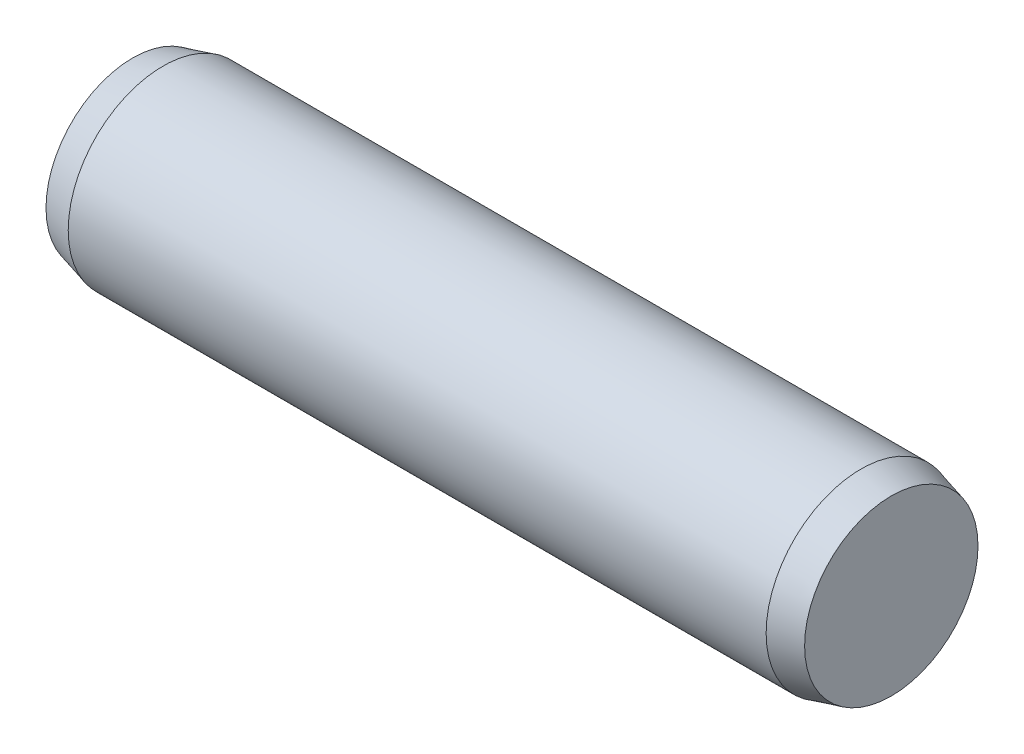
ISO-10303-21;
HEADER;
FILE_DESCRIPTION(('STEP AP214'),'2;1');
FILE_NAME('part.step','',(''),(''),'','','');
FILE_SCHEMA(('AUTOMOTIVE_DESIGN { 1 0 10303 214 1 1 1 1 }'));
ENDSEC;
DATA;
#1=APPLICATION_CONTEXT('core data for automotive mechanical design processes');
#2=APPLICATION_PROTOCOL_DEFINITION('international standard','automotive_design',2000,#1);
#3=PRODUCT_CONTEXT('',#1,'mechanical');
#4=PRODUCT('Part','Part','',(#3));
#5=PRODUCT_RELATED_PRODUCT_CATEGORY('part','',(#4));
#6=PRODUCT_DEFINITION_FORMATION('','',#4);
#7=PRODUCT_DEFINITION_CONTEXT('part definition',#1,'design');
#8=PRODUCT_DEFINITION('design','',#6,#7);
#9=PRODUCT_DEFINITION_SHAPE('','',#8);
#10=(LENGTH_UNIT() NAMED_UNIT(*) SI_UNIT(.MILLI.,.METRE.));
#11=(NAMED_UNIT(*) PLANE_ANGLE_UNIT() SI_UNIT($,.RADIAN.));
#12=(NAMED_UNIT(*) SI_UNIT($,.STERADIAN.) SOLID_ANGLE_UNIT());
#13=UNCERTAINTY_MEASURE_WITH_UNIT(LENGTH_MEASURE(1.E-05),#10,'distance_accuracy_value','');
#14=(GEOMETRIC_REPRESENTATION_CONTEXT(3) GLOBAL_UNCERTAINTY_ASSIGNED_CONTEXT((#13)) GLOBAL_UNIT_ASSIGNED_CONTEXT((#10,
#11,#12)) REPRESENTATION_CONTEXT('',''));
#15=CARTESIAN_POINT('',(0.,0.,0.));
#16=DIRECTION('',(0.,0.,1.));
#17=DIRECTION('',(1.,0.,0.));
#18=AXIS2_PLACEMENT_3D('',#15,#16,#17);
#19=CARTESIAN_POINT('',(-4.6,0.,0.));
#20=DIRECTION('',(1.,0.,0.));
#21=DIRECTION('',(0.,0.,-1.));
#22=AXIS2_PLACEMENT_3D('',#19,#20,#21);
#23=CYLINDRICAL_SURFACE('',#22,1.25);
#24=CARTESIAN_POINT('',(-4.6,0.,0.));
#25=DIRECTION('',(-1.,0.,0.));
#26=DIRECTION('',(0.,0.,1.));
#27=AXIS2_PLACEMENT_3D('',#24,#25,#26);
#28=CIRCLE('',#27,1.25);
#29=CARTESIAN_POINT('',(-4.6,0.,1.25));
#30=VERTEX_POINT('',#29);
#31=EDGE_CURVE('E44',#30,#30,#28,.T.);
#32=ORIENTED_EDGE('',*,*,#31,.F.);
#33=EDGE_LOOP('',(#32));
#34=FACE_BOUND('',#33,.T.);
#35=CARTESIAN_POINT('',(4.6,0.,0.));
#36=DIRECTION('',(1.,0.,0.));
#37=DIRECTION('',(0.,0.,-1.));
#38=AXIS2_PLACEMENT_3D('',#35,#36,#37);
#39=CIRCLE('',#38,1.25);
#40=CARTESIAN_POINT('',(4.6,0.,-1.25));
#41=VERTEX_POINT('',#40);
#42=EDGE_CURVE('E10',#41,#41,#39,.T.);
#43=ORIENTED_EDGE('',*,*,#42,.F.);
#44=EDGE_LOOP('',(#43));
#45=FACE_BOUND('',#44,.T.);
#46=ADVANCED_FACE('F30',(#34,#45),#23,.T.);
#47=CARTESIAN_POINT('',(4.6,0.,0.));
#48=DIRECTION('',(-1.,0.,0.));
#49=DIRECTION('',(0.,0.,-1.));
#50=AXIS2_PLACEMENT_3D('',#47,#48,#49);
#51=CONICAL_SURFACE('',#50,1.25,0.26179938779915);
#52=CARTESIAN_POINT('',(5.,0.,0.));
#53=DIRECTION('',(1.,0.,0.));
#54=DIRECTION('',(0.,0.,-1.));
#55=AXIS2_PLACEMENT_3D('',#52,#53,#54);
#56=CIRCLE('',#55,1.14282032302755);
#57=CARTESIAN_POINT('',(5.,0.,-1.14282032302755));
#58=VERTEX_POINT('',#57);
#59=EDGE_CURVE('E36',#58,#58,#56,.T.);
#60=ORIENTED_EDGE('',*,*,#59,.F.);
#61=EDGE_LOOP('',(#60));
#62=FACE_BOUND('',#61,.T.);
#63=ORIENTED_EDGE('',*,*,#42,.T.);
#64=EDGE_LOOP('',(#63));
#65=FACE_BOUND('',#64,.T.);
#66=ADVANCED_FACE('F54',(#62,#65),#51,.T.);
#67=CARTESIAN_POINT('',(5.,0.,0.));
#68=DIRECTION('',(1.,0.,0.));
#69=DIRECTION('',(0.,0.,-1.));
#70=AXIS2_PLACEMENT_3D('',#67,#68,#69);
#71=PLANE('',#70);
#72=ORIENTED_EDGE('',*,*,#59,.T.);
#73=EDGE_LOOP('',(#72));
#74=FACE_BOUND('',#73,.T.);
#75=ADVANCED_FACE('F58',(#74),#71,.T.);
#76=CARTESIAN_POINT('',(-4.6,0.,0.));
#77=DIRECTION('',(1.,0.,0.));
#78=DIRECTION('',(0.,0.,1.));
#79=AXIS2_PLACEMENT_3D('',#76,#77,#78);
#80=CONICAL_SURFACE('',#79,1.25,0.26179938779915);
#81=CARTESIAN_POINT('',(-5.,0.,0.));
#82=DIRECTION('',(-1.,0.,0.));
#83=DIRECTION('',(0.,0.,1.));
#84=AXIS2_PLACEMENT_3D('',#81,#82,#83);
#85=CIRCLE('',#84,1.14282032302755);
#86=CARTESIAN_POINT('',(-5.,0.,1.14282032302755));
#87=VERTEX_POINT('',#86);
#88=EDGE_CURVE('E40',#87,#87,#85,.T.);
#89=ORIENTED_EDGE('',*,*,#88,.F.);
#90=EDGE_LOOP('',(#89));
#91=FACE_BOUND('',#90,.T.);
#92=ORIENTED_EDGE('',*,*,#31,.T.);
#93=EDGE_LOOP('',(#92));
#94=FACE_BOUND('',#93,.T.);
#95=ADVANCED_FACE('F50',(#91,#94),#80,.T.);
#96=CARTESIAN_POINT('',(-5.,0.,0.));
#97=DIRECTION('',(-1.,0.,0.));
#98=DIRECTION('',(0.,0.,1.));
#99=AXIS2_PLACEMENT_3D('',#96,#97,#98);
#100=PLANE('',#99);
#101=ORIENTED_EDGE('',*,*,#88,.T.);
#102=EDGE_LOOP('',(#101));
#103=FACE_BOUND('',#102,.T.);
#104=ADVANCED_FACE('F67',(#103),#100,.T.);
#105=CLOSED_SHELL('',(#46,#66,#75,#95,#104));
#106=MANIFOLD_SOLID_BREP('B2',#105);
#107=ADVANCED_BREP_SHAPE_REPRESENTATION('',(#18,#106),#14);
#108=SHAPE_DEFINITION_REPRESENTATION(#9,#107);
ENDSEC;
END-ISO-10303-21;
